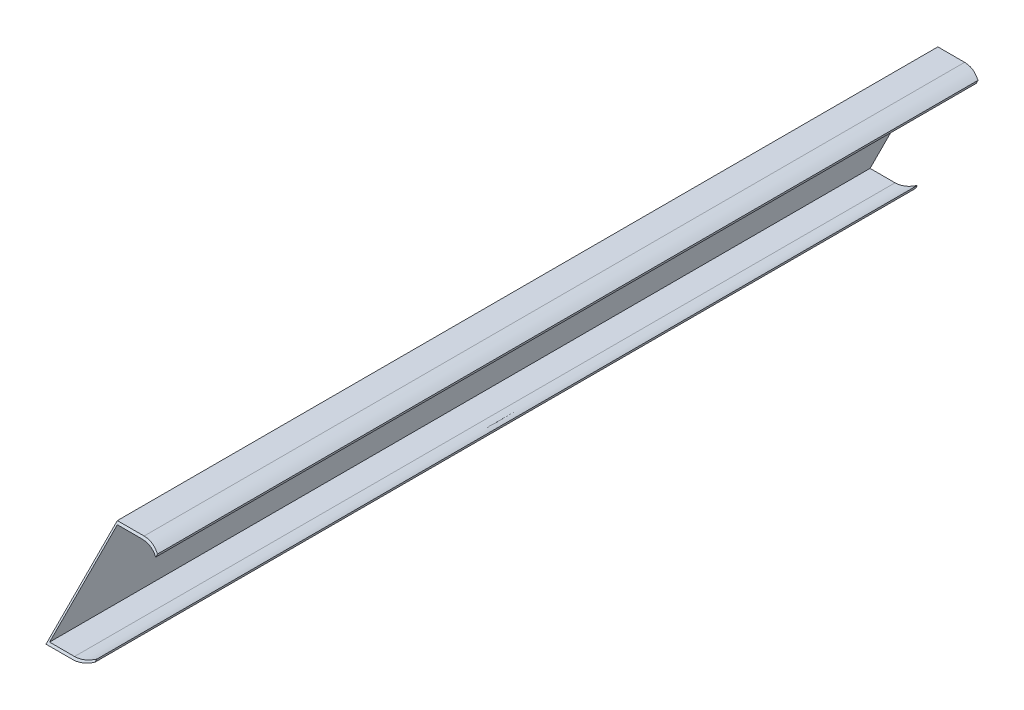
from build123d import *

# Parameters (mm, degrees)
EXTRUSION1_DEPTH = 1000
EXTRUSION5_REACH = 1006.44


with BuildPart() as part:
    # Esquisse1 → Extrusion1 (new body)
    with BuildSketch(Plane.XY):
        with BuildLine():
            Line((0, 0), (0, 80))
            Line((0, 80), (30, 80))
            add(Edge.make_bspline(
                [(30, 80), (40.603281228, 79.951543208), (50, 75)],
                knots=[0, 0, 0, 1, 1, 1], degree=2))
            Line((50, 75), (50, 73))
            add(Edge.make_bspline(
                [(30, 78), (40.603281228, 77.951543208), (50, 73)],
                knots=[0, 0, 0, 1, 1, 1], degree=2))
            Line((30, 78), (2, 78))
            Line((2, 78), (2, 2))
            Line((2, 2), (30, 2))
            add(Edge.make_bspline(
                [(30, 2), (40.603281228, 2.048456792), (50, 7)],
                knots=[0, 0, 0, 1, 1, 1], degree=2))
            Line((50, 7), (50, 5))
            add(Edge.make_bspline(
                [(30, 0), (40.603281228, 0.048456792), (50, 5)],
                knots=[0, 0, 0, 1, 1, 1], degree=2))
            Line((30, 0), (0, 0))
        make_face()
    extrude(amount=EXTRUSION1_DEPTH)

    # Esquisse4 → Extrusion5 (cut, up to next)
    with BuildSketch(Plane.ZY, mode=Mode.PRIVATE) as extrusion5_sk1:
        Polygon((1000, 0), (920, 80), (1000, 80), align=None)
    extrusion5_tool1 = extrude(extrusion5_sk1.sketch, amount=-EXTRUSION5_REACH, mode=Mode.PRIVATE) & part.part
    # Esquisse4 → Extrusion5 (cut, up to next)
    with BuildSketch(Plane.ZY, mode=Mode.PRIVATE) as extrusion5_sk2:
        Polygon((0, 80), (0, 0), (80, 0), align=None)
    extrusion5_tool2 = extrude(extrusion5_sk2.sketch, amount=-EXTRUSION5_REACH, mode=Mode.PRIVATE) & part.part
    add(extrusion5_tool1.solids().sort_by_distance((0, 53.333333, 973.333333))[0], mode=Mode.SUBTRACT)
    add(extrusion5_tool2.solids().sort_by_distance((0, 26.666667, 26.666667))[0], mode=Mode.SUBTRACT)


solid = part.part
